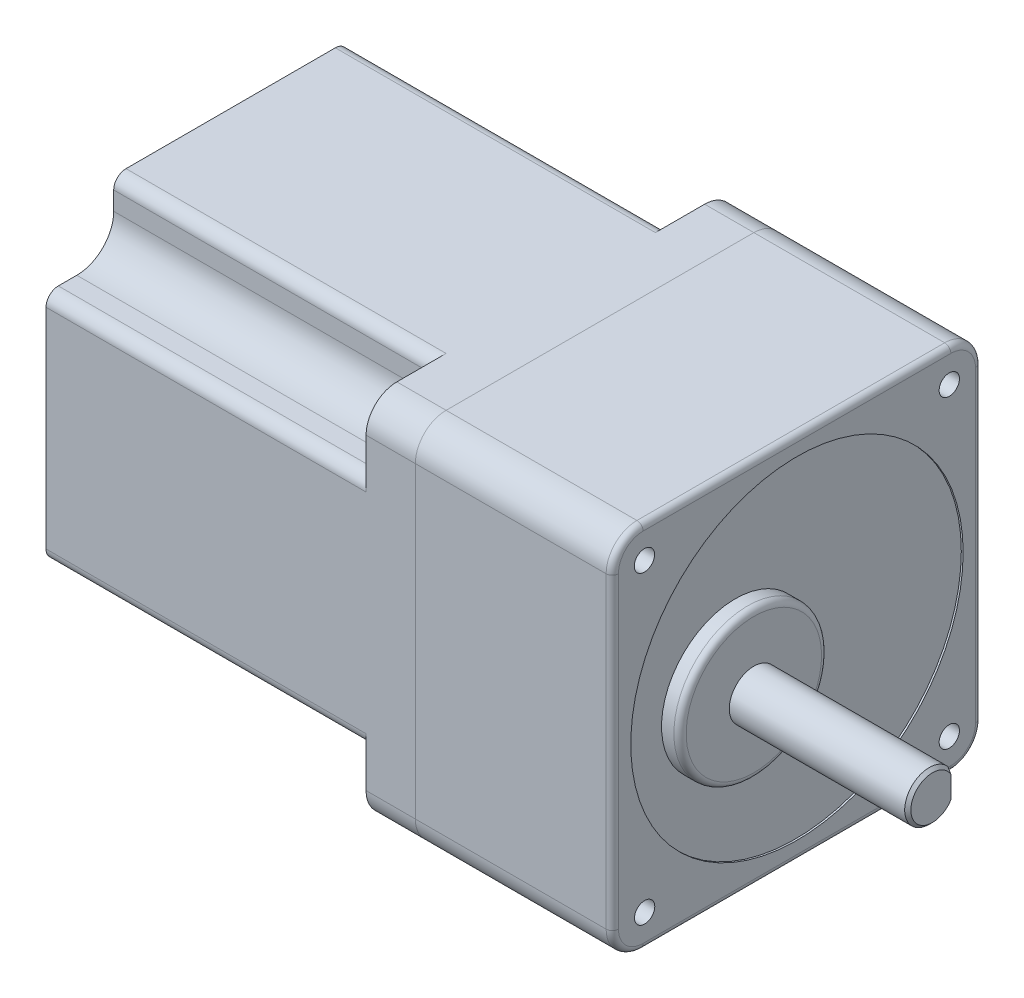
from build123d import *

# Parameters (mm, degrees)
EXTRUDE_1_DEPTH             = 8
SKETCH_3_R                  = 3
CUT_EXTRUDE_1_DEPTH         = 8
EXTRUDE_2_DEPTH             = 52
EXTRUDE_3_DEPTH             = 32
HOLE_WIZARD_M4_1_AT_2_COUNT = 2
HOLE_WIZARD_M4_1_AT_2_PITCH = 49.528083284
HOLE_WIZARD_M4_1_AT_3_COUNT = 2
HOLE_WIZARD_M4_1_AT_3_PITCH = 70.043273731
HOLE_WIZARD_M4_1_AT_4_COUNT = 2
HOLE_WIZARD_M4_1_AT_4_PITCH = 49.528083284
CUT_EXTRUDE_START           = -20
SKETCH_8_R                  = 3
CUT_EXTRUDE_2_DEPTH         = 20
SKETCH_9_R                  = 12
EXTRUDE_4_DEPTH             = 3
FILLET_1_R                  = 1
SKETCH_10_R                 = 4
EXTRUDE_5_DEPTH             = 29
CUT_EXTRUDE_3_DEPTH         = 25
CHAMFER_1_SIZE              = 0.5
SKETCH_12_R                 = 27
CUT_EXTRUDE_4_DEPTH         = 0.3
FILLET_2_R                  = 1


with BuildPart() as part:
    # Sketch 1 → Extrude 1 (new body)
    with BuildSketch(Plane(origin=(0, 0, 0), x_dir=(0, 0, -1), z_dir=(1, 0, 0))):
        with BuildLine():
            Line((-25, -30), (25, -30))
            ThreePointArc((25, -30), (28.535533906, -28.535533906), (30, -25))
            Line((30, -25), (30, 25))
            ThreePointArc((30, 25), (28.535533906, 28.535533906), (25, 30))
            Line((25, 30), (-25, 30))
            ThreePointArc((-25, 30), (-28.535533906, 28.535533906), (-30, 25))
            Line((-30, 25), (-30, -25))
            ThreePointArc((-30, -25), (-28.535533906, -28.535533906), (-25, -30))
        make_face()
    extrude(amount=-EXTRUDE_1_DEPTH)

    # Sketch 3 → Cut-Extrude 1 (cut)
    with BuildSketch(Plane(origin=(0, 0, 0), x_dir=(0, 0, -1), z_dir=(1, 0, 0))):
        with Locations((-24.748737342, 24.748737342)):
            Circle(SKETCH_3_R)
        with Locations((24.748737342, 24.748737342)):
            Circle(SKETCH_3_R)
        with Locations((24.748737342, -24.748737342)):
            Circle(SKETCH_3_R)
        with Locations((-24.748737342, -24.748737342)):
            Circle(SKETCH_3_R)
    extrude(amount=-CUT_EXTRUDE_1_DEPTH, mode=Mode.SUBTRACT)

    # Sketch 4 → Extrude 2 (add)
    with BuildSketch(Plane.ZY.offset(8)):
        with BuildLine():
            Line((-25, 19), (-28, 19))
            ThreePointArc((-28, 19), (-29.414213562, 18.414213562), (-30, 17))
            Line((-30, 17), (-30, -17))
            ThreePointArc((-30, -17), (-29.414213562, -18.414213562), (-28, -19))
            Line((-28, -19), (-25, -19))
            ThreePointArc((-25, -19), (-20.757359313, -20.757359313), (-19, -25))
            Line((-19, -25), (-19, -28))
            ThreePointArc((-19, -28), (-18.414213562, -29.414213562), (-17, -30))
            Line((-17, -30), (17, -30))
            ThreePointArc((17, -30), (18.414213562, -29.414213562), (19, -28))
            Line((19, -28), (19, -25))
            ThreePointArc((19, -25), (20.757359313, -20.757359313), (25, -19))
            Line((25, -19), (28, -19))
            ThreePointArc((28, -19), (29.414213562, -18.414213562), (30, -17))
            Line((30, -17), (30, 17))
            ThreePointArc((30, 17), (29.414213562, 18.414213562), (28, 19))
            Line((28, 19), (25, 19))
            ThreePointArc((25, 19), (20.757359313, 20.757359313), (19, 25))
            Line((19, 25), (19, 28))
            ThreePointArc((19, 28), (18.414213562, 29.414213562), (17, 30))
            Line((17, 30), (-17, 30))
            ThreePointArc((-17, 30), (-18.414213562, 29.414213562), (-19, 28))
            Line((-19, 28), (-19, 25))
            ThreePointArc((-19, 25), (-20.757359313, 20.757359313), (-25, 19))
        make_face()
    extrude(amount=EXTRUDE_2_DEPTH)


with BuildPart() as body_2:
    # Sketch 5 → Extrude 3 (new body)
    with BuildSketch(Plane(origin=(0, 0, 0), x_dir=(0, 0, -1), z_dir=(1, 0, 0))):
        with BuildLine():
            Line((-25, -30), (25, -30))
            ThreePointArc((25, -30), (28.535533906, -28.535533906), (30, -25))
            Line((30, -25), (30, 25))
            ThreePointArc((30, 25), (28.535533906, 28.535533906), (25, 30))
            Line((25, 30), (-25, 30))
            ThreePointArc((-25, 30), (-28.535533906, 28.535533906), (-30, 25))
            Line((-30, 25), (-30, -25))
            ThreePointArc((-30, -25), (-28.535533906, -28.535533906), (-25, -30))
        make_face()
    extrude(amount=EXTRUDE_3_DEPTH)

    # Sketch 7 → Hole Wizard M4 _1 (revolve, cut)
    with BuildSketch(Plane(origin=(32, 24.77933649, 24.77933649), x_dir=(0, 0, -1), z_dir=(0, 1, 0))):
        Polygon((0, 0), (0, 12.991420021), (1.65, 12), (1.65, 0), align=None)
    hole_wizard_m4_1 = revolve(axis=Axis((38.35, 24.77933649, 24.77933649), (-1, 0, 0)), mode=Mode.SUBTRACT)

    # Hole Wizard M4 _1 at 2: Hole Wizard M4 _1 ×2
    with Locations(*[Vector(0, -0.000617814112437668, -0.9999998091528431) * (i * HOLE_WIZARD_M4_1_AT_2_PITCH) for i in range(1, HOLE_WIZARD_M4_1_AT_2_COUNT)]):
        add(hole_wizard_m4_1, mode=Mode.SUBTRACT)

    # Hole Wizard M4 _1 at 3: Hole Wizard M4 _1 ×2
    with Locations(*[Vector(0, -0.7071067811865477, -0.7071067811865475) * (i * HOLE_WIZARD_M4_1_AT_3_PITCH) for i in range(1, HOLE_WIZARD_M4_1_AT_3_COUNT)]):
        add(hole_wizard_m4_1, mode=Mode.SUBTRACT)

    # Hole Wizard M4 _1 at 4: Hole Wizard M4 _1 ×2
    with Locations(*[Vector(0, -0.9999998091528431, -0.0006178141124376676) * (i * HOLE_WIZARD_M4_1_AT_4_PITCH) for i in range(1, HOLE_WIZARD_M4_1_AT_4_COUNT)]):
        add(hole_wizard_m4_1, mode=Mode.SUBTRACT)

    # Sketch 8 → Cut-Extrude 2 (cut)
    with BuildSketch(Plane.ZY.offset(CUT_EXTRUDE_START)):
        with Locations((-24.748737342, 24.748737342)):
            Circle(SKETCH_8_R)
        with Locations((24.748737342, 24.748737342)):
            Circle(SKETCH_8_R)
        with Locations((24.748737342, -24.748737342)):
            Circle(SKETCH_8_R)
        with Locations((-24.748737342, -24.748737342)):
            Circle(SKETCH_8_R)
    extrude(amount=CUT_EXTRUDE_2_DEPTH, mode=Mode.SUBTRACT)

    # Sketch 9 → Extrude 4 (add)
    with BuildSketch(Plane(origin=(32, 0, 0), x_dir=(0, 0, -1), z_dir=(1, 0, 0))):
        with Locations(Location((-10, 0, 0), (0, 0, 180))):
            Circle(SKETCH_9_R)
    extrude(amount=EXTRUDE_4_DEPTH)

    # Fillet 1
    fillet_1_edges = [body_2.edges().sort_by_distance(p)[0] for p in [
        (35, 0, -2),
    ]]
    fillet(fillet_1_edges, radius=FILLET_1_R)

    # Sketch 10 → Extrude 5 (add)
    with BuildSketch(Plane(origin=(35, 0, 0), x_dir=(0, 0, -1), z_dir=(1, 0, 0))):
        with Locations(Location((-10, 0, 0), (0, 0, 180))):
            Circle(SKETCH_10_R)
    extrude(amount=EXTRUDE_5_DEPTH)

    # Sketch 11 → Cut-Extrude 3 (cut)
    with BuildSketch(Plane(origin=(64, 0, 0), x_dir=(0, 0, -1), z_dir=(1, 0, 0))):
        with BuildLine():
            Line((-7, 2.645751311), (-7, -2.645751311))
            ThreePointArc((-7, -2.645751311), (-6, 0), (-7, 2.645751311))
        make_face()
    extrude(amount=-CUT_EXTRUDE_3_DEPTH, mode=Mode.SUBTRACT)

    # Chamfer 1
    chamfer_1_edges = [body_2.edges().sort_by_distance(p)[0] for p in [
        (64, 3.741657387, 11.414213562),
    ]]
    chamfer(chamfer_1_edges, length=CHAMFER_1_SIZE)

    # Sketch 12 → Cut-Extrude 4 (cut)
    with BuildSketch(Plane(origin=(32, 0, 0), x_dir=(0, 0, -1), z_dir=(1, 0, 0))):
        Circle(SKETCH_12_R)
    extrude(amount=-CUT_EXTRUDE_4_DEPTH, mode=Mode.SUBTRACT)


with BuildPart() as cut_extrude_4_piece_1:
    # of the separate pieces the step leaves, piece 1, a body of its own (cut_extrude_4_pieces)
    add(body_2.part.solids().sort_by_distance((32, -25, 30))[0])

    # Fillet 2
    fillet_2_edges = [cut_extrude_4_piece_1.edges().sort_by_distance(p)[0] for p in [
        (32, -28.535533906, 28.535533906),
        (32, -30, 0),
        (32, -28.535533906, -28.535533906),
        (32, 0, -30),
        (32, 28.535533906, -28.535533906),
        (32, 30, 0),
        (32, 28.535533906, 28.535533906),
        (32, 0, 30),
    ]]
    fillet(fillet_2_edges, radius=FILLET_2_R)


with BuildPart() as cut_extrude_4_piece_2:
    # of the separate pieces the step leaves, piece 2, a body of its own (cut_extrude_4_pieces)
    add(body_2.part.solids().sort_by_distance((63.5, 0, 14))[0])


solid = Compound([part.part, cut_extrude_4_piece_1.part, cut_extrude_4_piece_2.part])
